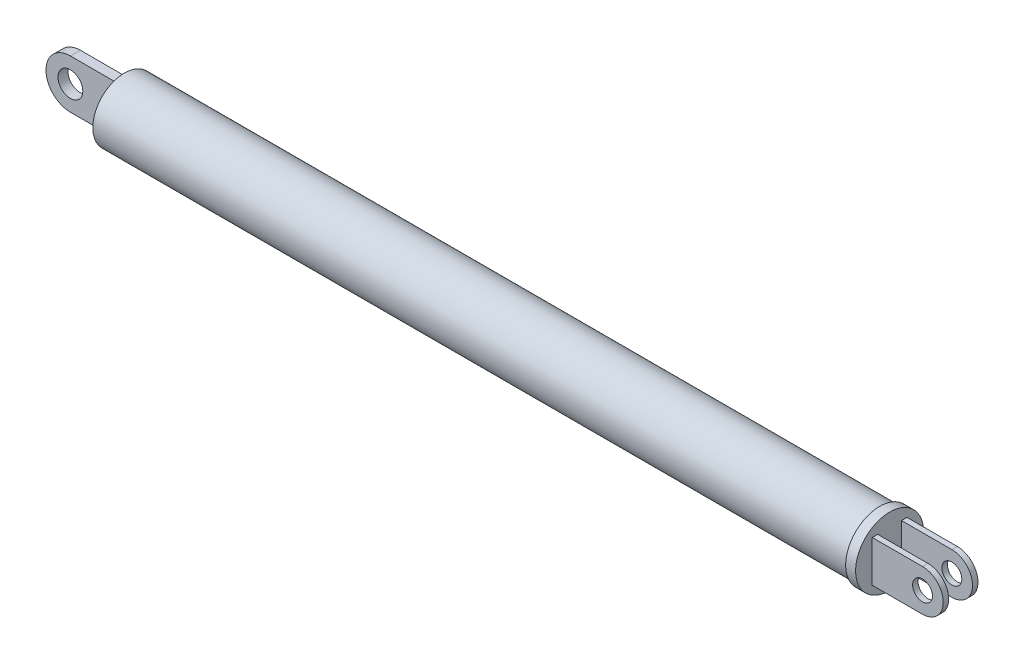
from build123d import *

# Parameters (mm, degrees)
SKETCH1_R               = 12.7
EXTRUDE1_DEPTH          = 304
SKETCH2_R               = 5
EXTRUDE2_DEPTH          = 2
SKETCH3_R               = 13.7
EXTRUDE3_DEPTH          = 4
SKETCH4_R               = 4
EXTRUDE4_DEPTH          = 7
CUT_EXTRUDE1_DEPTH      = 338.12080449
CUT_EXTRUDE1_DEPTH_BACK = 338.12080449
SKETCH5_W               = 51.727972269
SKETCH5_H               = 9.602426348


with BuildPart() as part:
    # Sketch1 → Extrude1 (new body)
    with BuildSketch(Plane(origin=(0, 0, 0), x_dir=(0, 0, -1), z_dir=(1, 0, 0))):
        Circle(SKETCH1_R)
    extrude(amount=EXTRUDE1_DEPTH)

    # Sketch2 → Extrude2 (add, symmetric)
    with BuildSketch(Plane.XY):
        with BuildLine():
            Line((0, 9.805687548), (-19.733094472, 9.805687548))
            ThreePointArc((-19.733094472, 9.805687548), (-29.53878202, 0), (-19.733094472, -9.805687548))
            Line((-19.733094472, -9.805687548), (0, -9.805687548))
            Line((0, -9.805687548), (0, 9.805687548))
        make_face()
        with Locations((-19.733094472, 0)):
            Circle(SKETCH2_R, mode=Mode.SUBTRACT)
    extrude(amount=EXTRUDE2_DEPTH, both=True)

    # Sketch3 → Extrude3 (add)
    with BuildSketch(Plane(origin=(304, 0, 0), x_dir=(0, 0, -1), z_dir=(1, 0, 0))):
        Circle(SKETCH3_R)
    extrude(amount=EXTRUDE3_DEPTH)

    # Sketch4 → Extrude4 (add, symmetric)
    with BuildSketch(Plane.XY):
        with BuildLine():
            Line((308, 8.324679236), (328.238920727, 8.324679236))
            ThreePointArc((328.238920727, 8.324679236), (336.563599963, 0), (328.238920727, -8.324679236))
            Line((328.238920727, -8.324679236), (308, -8.324679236))
            Line((308, -8.324679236), (308, 8.324679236))
        make_face()
        with Locations((328.238920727, 0)):
            Circle(SKETCH4_R, mode=Mode.SUBTRACT)
    extrude(amount=EXTRUDE4_DEPTH, both=True)

    # Sketch5 → Cut-Extrude1 (cut, two sides: drawn at the far end of the back side and taken through both)
    with BuildSketch(Plane(origin=(0, 0, 0), x_dir=(1, 0, 0), z_dir=(0, 1, 0)).offset(-CUT_EXTRUDE1_DEPTH_BACK)):
        with Locations((333.863986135, 0)):
            Rectangle(SKETCH5_W, SKETCH5_H)
    extrude(amount=CUT_EXTRUDE1_DEPTH + CUT_EXTRUDE1_DEPTH_BACK, mode=Mode.SUBTRACT)


solid = part.part
